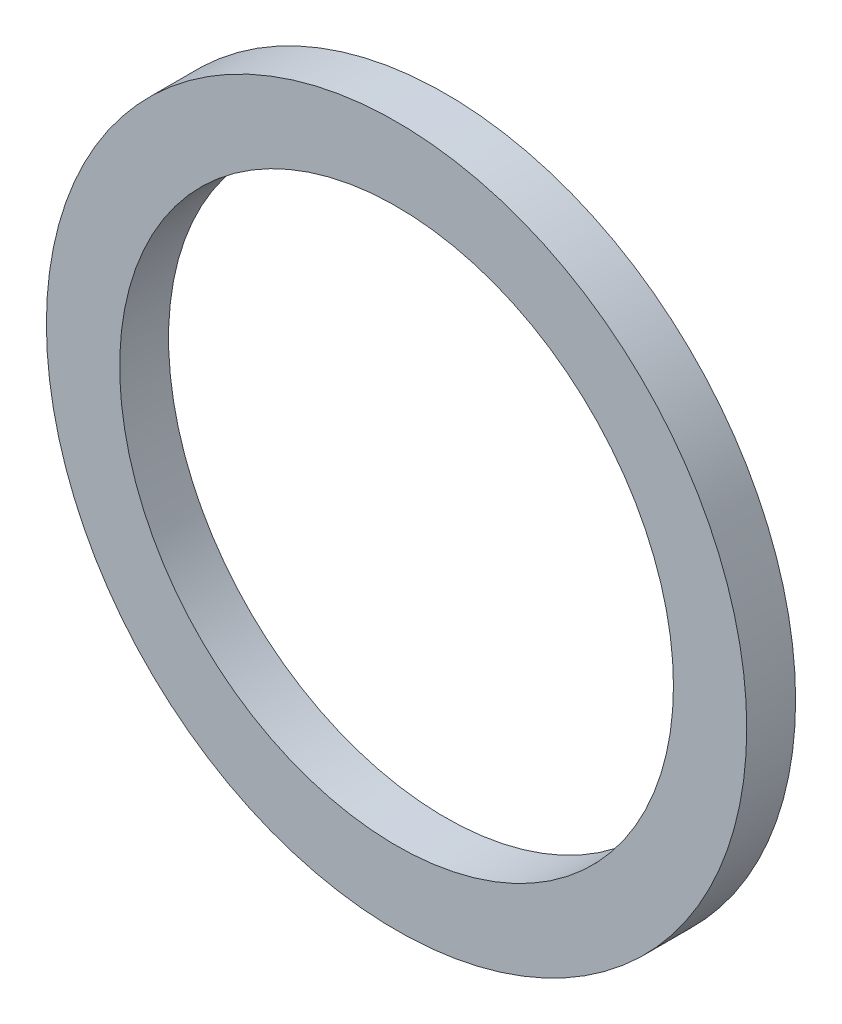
ISO-10303-21;
HEADER;
FILE_DESCRIPTION(('STEP AP214'),'2;1');
FILE_NAME('part.step','',(''),(''),'','','');
FILE_SCHEMA(('AUTOMOTIVE_DESIGN { 1 0 10303 214 1 1 1 1 }'));
ENDSEC;
DATA;
#1=APPLICATION_CONTEXT('core data for automotive mechanical design processes');
#2=APPLICATION_PROTOCOL_DEFINITION('international standard','automotive_design',2000,#1);
#3=PRODUCT_CONTEXT('',#1,'mechanical');
#4=PRODUCT('Part','Part','',(#3));
#5=PRODUCT_RELATED_PRODUCT_CATEGORY('part','',(#4));
#6=PRODUCT_DEFINITION_FORMATION('','',#4);
#7=PRODUCT_DEFINITION_CONTEXT('part definition',#1,'design');
#8=PRODUCT_DEFINITION('design','',#6,#7);
#9=PRODUCT_DEFINITION_SHAPE('','',#8);
#10=(LENGTH_UNIT() NAMED_UNIT(*) SI_UNIT(.MILLI.,.METRE.));
#11=(NAMED_UNIT(*) PLANE_ANGLE_UNIT() SI_UNIT($,.RADIAN.));
#12=(NAMED_UNIT(*) SI_UNIT($,.STERADIAN.) SOLID_ANGLE_UNIT());
#13=UNCERTAINTY_MEASURE_WITH_UNIT(LENGTH_MEASURE(1.E-05),#10,'distance_accuracy_value','');
#14=(GEOMETRIC_REPRESENTATION_CONTEXT(3) GLOBAL_UNCERTAINTY_ASSIGNED_CONTEXT((#13)) GLOBAL_UNIT_ASSIGNED_CONTEXT((#10,
#11,#12)) REPRESENTATION_CONTEXT('',''));
#15=CARTESIAN_POINT('',(0.,0.,0.));
#16=DIRECTION('',(0.,0.,1.));
#17=DIRECTION('',(1.,0.,0.));
#18=AXIS2_PLACEMENT_3D('',#15,#16,#17);
#19=CARTESIAN_POINT('',(0.,0.,-3.));
#20=DIRECTION('',(0.,0.,1.));
#21=DIRECTION('',(1.,0.,0.));
#22=AXIS2_PLACEMENT_3D('',#19,#20,#21);
#23=CYLINDRICAL_SURFACE('',#22,21.5);
#24=CARTESIAN_POINT('',(0.,0.,-3.));
#25=DIRECTION('',(0.,0.,1.));
#26=DIRECTION('',(1.,0.,0.));
#27=AXIS2_PLACEMENT_3D('',#24,#25,#26);
#28=CIRCLE('',#27,21.5);
#29=CARTESIAN_POINT('',(21.5,0.,-3.));
#30=VERTEX_POINT('',#29);
#31=EDGE_CURVE('E10',#30,#30,#28,.T.);
#32=ORIENTED_EDGE('',*,*,#31,.T.);
#33=EDGE_LOOP('',(#32));
#34=FACE_BOUND('',#33,.T.);
#35=CARTESIAN_POINT('',(0.,0.,0.));
#36=DIRECTION('',(0.,0.,1.));
#37=DIRECTION('',(1.,0.,0.));
#38=AXIS2_PLACEMENT_3D('',#35,#36,#37);
#39=CIRCLE('',#38,21.5);
#40=CARTESIAN_POINT('',(21.5,0.,0.));
#41=VERTEX_POINT('',#40);
#42=EDGE_CURVE('E352',#41,#41,#39,.T.);
#43=ORIENTED_EDGE('',*,*,#42,.F.);
#44=EDGE_LOOP('',(#43));
#45=FACE_BOUND('',#44,.T.);
#46=ADVANCED_FACE('F346',(#34,#45),#23,.T.);
#47=CARTESIAN_POINT('',(0.,0.,-3.));
#48=DIRECTION('',(0.,0.,1.));
#49=DIRECTION('',(1.,0.,0.));
#50=AXIS2_PLACEMENT_3D('',#47,#48,#49);
#51=PLANE('',#50);
#52=CARTESIAN_POINT('',(0.,0.,-3.));
#53=DIRECTION('',(0.,0.,1.));
#54=DIRECTION('',(1.,0.,0.));
#55=AXIS2_PLACEMENT_3D('',#52,#53,#54);
#56=CIRCLE('',#55,17.);
#57=CARTESIAN_POINT('',(17.,0.,-3.));
#58=VERTEX_POINT('',#57);
#59=EDGE_CURVE('E356',#58,#58,#56,.T.);
#60=ORIENTED_EDGE('',*,*,#59,.T.);
#61=EDGE_LOOP('',(#60));
#62=FACE_BOUND('',#61,.T.);
#63=ORIENTED_EDGE('',*,*,#31,.F.);
#64=EDGE_LOOP('',(#63));
#65=FACE_BOUND('',#64,.T.);
#66=ADVANCED_FACE('F370',(#62,#65),#51,.F.);
#67=CARTESIAN_POINT('',(0.,0.,0.));
#68=DIRECTION('',(0.,0.,1.));
#69=DIRECTION('',(1.,0.,0.));
#70=AXIS2_PLACEMENT_3D('',#67,#68,#69);
#71=PLANE('',#70);
#72=CARTESIAN_POINT('',(0.,0.,0.));
#73=DIRECTION('',(0.,0.,1.));
#74=DIRECTION('',(1.,0.,0.));
#75=AXIS2_PLACEMENT_3D('',#72,#73,#74);
#76=CIRCLE('',#75,17.);
#77=CARTESIAN_POINT('',(17.,0.,0.));
#78=VERTEX_POINT('',#77);
#79=EDGE_CURVE('E360',#78,#78,#76,.T.);
#80=ORIENTED_EDGE('',*,*,#79,.F.);
#81=EDGE_LOOP('',(#80));
#82=FACE_BOUND('',#81,.T.);
#83=ORIENTED_EDGE('',*,*,#42,.T.);
#84=EDGE_LOOP('',(#83));
#85=FACE_BOUND('',#84,.T.);
#86=ADVANCED_FACE('F368',(#82,#85),#71,.T.);
#87=CARTESIAN_POINT('',(0.,0.,-3.));
#88=DIRECTION('',(0.,0.,1.));
#89=DIRECTION('',(1.,0.,0.));
#90=AXIS2_PLACEMENT_3D('',#87,#88,#89);
#91=CYLINDRICAL_SURFACE('',#90,17.);
#92=ORIENTED_EDGE('',*,*,#59,.F.);
#93=EDGE_LOOP('',(#92));
#94=FACE_BOUND('',#93,.T.);
#95=ORIENTED_EDGE('',*,*,#79,.T.);
#96=EDGE_LOOP('',(#95));
#97=FACE_BOUND('',#96,.T.);
#98=ADVANCED_FACE('F366',(#94,#97),#91,.F.);
#99=CLOSED_SHELL('',(#46,#66,#86,#98));
#100=MANIFOLD_SOLID_BREP('B2',#99);
#101=ADVANCED_BREP_SHAPE_REPRESENTATION('',(#18,#100),#14);
#102=SHAPE_DEFINITION_REPRESENTATION(#9,#101);
ENDSEC;
END-ISO-10303-21;
